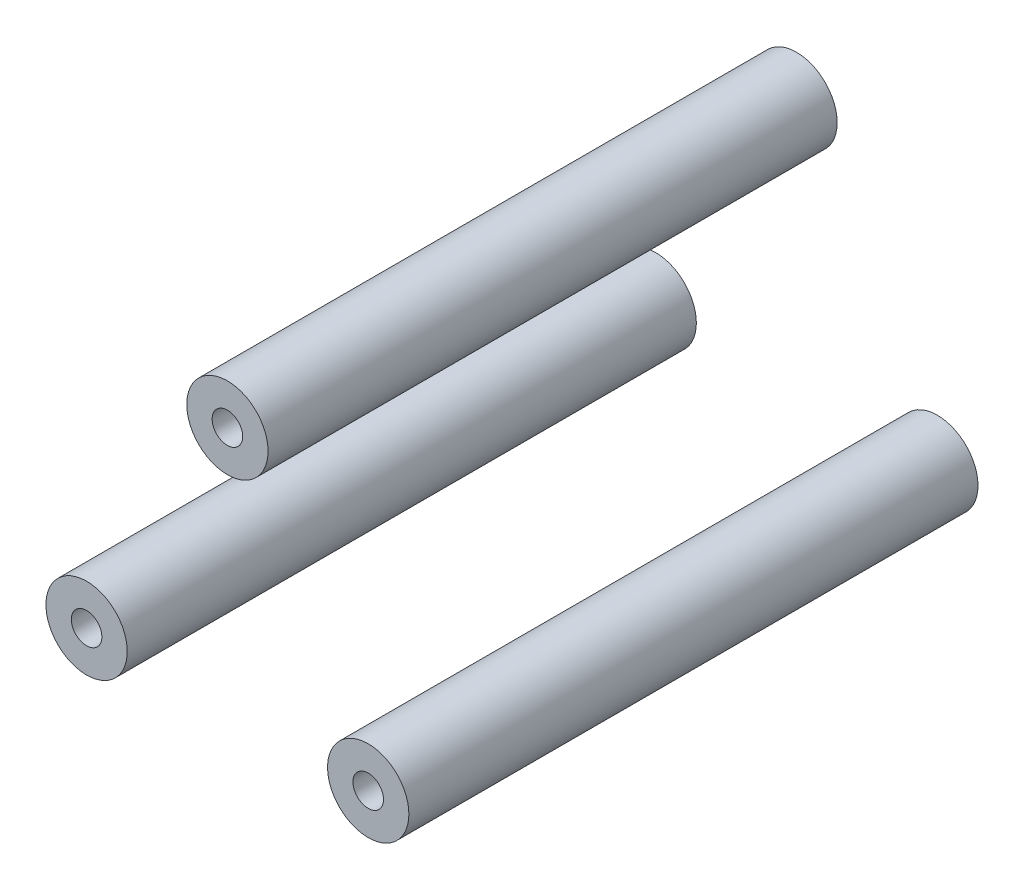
ISO-10303-21;
HEADER;
FILE_DESCRIPTION(('STEP AP214'),'2;1');
FILE_NAME('part.step','',(''),(''),'','','');
FILE_SCHEMA(('AUTOMOTIVE_DESIGN { 1 0 10303 214 1 1 1 1 }'));
ENDSEC;
DATA;
#1=APPLICATION_CONTEXT('core data for automotive mechanical design processes');
#2=APPLICATION_PROTOCOL_DEFINITION('international standard','automotive_design',2000,#1);
#3=PRODUCT_CONTEXT('',#1,'mechanical');
#4=PRODUCT('Part','Part','',(#3));
#5=PRODUCT_RELATED_PRODUCT_CATEGORY('part','',(#4));
#6=PRODUCT_DEFINITION_FORMATION('','',#4);
#7=PRODUCT_DEFINITION_CONTEXT('part definition',#1,'design');
#8=PRODUCT_DEFINITION('design','',#6,#7);
#9=PRODUCT_DEFINITION_SHAPE('','',#8);
#10=(LENGTH_UNIT() NAMED_UNIT(*) SI_UNIT(.MILLI.,.METRE.));
#11=(NAMED_UNIT(*) PLANE_ANGLE_UNIT() SI_UNIT($,.RADIAN.));
#12=(NAMED_UNIT(*) SI_UNIT($,.STERADIAN.) SOLID_ANGLE_UNIT());
#13=UNCERTAINTY_MEASURE_WITH_UNIT(LENGTH_MEASURE(1.E-05),#10,'distance_accuracy_value','');
#14=(GEOMETRIC_REPRESENTATION_CONTEXT(3) GLOBAL_UNCERTAINTY_ASSIGNED_CONTEXT((#13)) GLOBAL_UNIT_ASSIGNED_CONTEXT((#10,
#11,#12)) REPRESENTATION_CONTEXT('',''));
#15=CARTESIAN_POINT('',(0.,0.,0.));
#16=DIRECTION('',(0.,0.,1.));
#17=DIRECTION('',(1.,0.,0.));
#18=AXIS2_PLACEMENT_3D('',#15,#16,#17);
#19=CARTESIAN_POINT('',(0.,25.4,88.9));
#20=DIRECTION('',(0.,0.,1.));
#21=DIRECTION('',(1.,0.,0.));
#22=AXIS2_PLACEMENT_3D('',#19,#20,#21);
#23=PLANE('',#22);
#24=CARTESIAN_POINT('',(0.,25.4,88.9));
#25=DIRECTION('',(0.,0.,1.));
#26=DIRECTION('',(1.,0.,0.));
#27=AXIS2_PLACEMENT_3D('',#24,#25,#26);
#28=CIRCLE('',#27,6.35);
#29=CARTESIAN_POINT('',(6.35,25.4,88.9));
#30=VERTEX_POINT('',#29);
#31=EDGE_CURVE('E11',#30,#30,#28,.T.);
#32=ORIENTED_EDGE('',*,*,#31,.T.);
#33=EDGE_LOOP('',(#32));
#34=FACE_BOUND('',#33,.T.);
#35=CARTESIAN_POINT('',(0.,25.4,88.9));
#36=DIRECTION('',(0.,0.,1.));
#37=DIRECTION('',(1.,0.,0.));
#38=AXIS2_PLACEMENT_3D('',#35,#36,#37);
#39=CIRCLE('',#38,2.3876);
#40=CARTESIAN_POINT('',(2.3876,25.4,88.9));
#41=VERTEX_POINT('',#40);
#42=EDGE_CURVE('E51',#41,#41,#39,.T.);
#43=ORIENTED_EDGE('',*,*,#42,.F.);
#44=EDGE_LOOP('',(#43));
#45=FACE_BOUND('',#44,.T.);
#46=ADVANCED_FACE('F40',(#34,#45),#23,.T.);
#47=CARTESIAN_POINT('',(0.,25.4,0.));
#48=DIRECTION('',(0.,0.,1.));
#49=DIRECTION('',(1.,0.,0.));
#50=AXIS2_PLACEMENT_3D('',#47,#48,#49);
#51=PLANE('',#50);
#52=CARTESIAN_POINT('',(0.,25.4,0.));
#53=DIRECTION('',(0.,0.,1.));
#54=DIRECTION('',(1.,0.,0.));
#55=AXIS2_PLACEMENT_3D('',#52,#53,#54);
#56=CIRCLE('',#55,6.35);
#57=CARTESIAN_POINT('',(6.35,25.4,0.));
#58=VERTEX_POINT('',#57);
#59=EDGE_CURVE('E44',#58,#58,#56,.T.);
#60=ORIENTED_EDGE('',*,*,#59,.F.);
#61=EDGE_LOOP('',(#60));
#62=FACE_BOUND('',#61,.T.);
#63=CARTESIAN_POINT('',(0.,25.4,0.));
#64=DIRECTION('',(0.,0.,1.));
#65=DIRECTION('',(1.,0.,0.));
#66=AXIS2_PLACEMENT_3D('',#63,#64,#65);
#67=CIRCLE('',#66,2.3876);
#68=CARTESIAN_POINT('',(2.3876,25.4,0.));
#69=VERTEX_POINT('',#68);
#70=EDGE_CURVE('E53',#69,#69,#67,.T.);
#71=ORIENTED_EDGE('',*,*,#70,.T.);
#72=EDGE_LOOP('',(#71));
#73=FACE_BOUND('',#72,.T.);
#74=ADVANCED_FACE('F63',(#62,#73),#51,.F.);
#75=CARTESIAN_POINT('',(0.,25.4,88.9));
#76=DIRECTION('',(0.,0.,-1.));
#77=DIRECTION('',(-1.,0.,0.));
#78=AXIS2_PLACEMENT_3D('',#75,#76,#77);
#79=CYLINDRICAL_SURFACE('',#78,6.35);
#80=ORIENTED_EDGE('',*,*,#31,.F.);
#81=EDGE_LOOP('',(#80));
#82=FACE_BOUND('',#81,.T.);
#83=ORIENTED_EDGE('',*,*,#59,.T.);
#84=EDGE_LOOP('',(#83));
#85=FACE_BOUND('',#84,.T.);
#86=ADVANCED_FACE('F42',(#82,#85),#79,.T.);
#87=CARTESIAN_POINT('',(0.,25.4,88.9));
#88=DIRECTION('',(0.,0.,-1.));
#89=DIRECTION('',(-1.,0.,0.));
#90=AXIS2_PLACEMENT_3D('',#87,#88,#89);
#91=CYLINDRICAL_SURFACE('',#90,2.3876);
#92=ORIENTED_EDGE('',*,*,#42,.T.);
#93=EDGE_LOOP('',(#92));
#94=FACE_BOUND('',#93,.T.);
#95=ORIENTED_EDGE('',*,*,#70,.F.);
#96=EDGE_LOOP('',(#95));
#97=FACE_BOUND('',#96,.T.);
#98=ADVANCED_FACE('F59',(#94,#97),#91,.F.);
#99=CLOSED_SHELL('',(#46,#74,#86,#98));
#100=MANIFOLD_SOLID_BREP('B2',#99);
#101=CARTESIAN_POINT('',(21.9970452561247,-12.7000000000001,88.9));
#102=DIRECTION('',(0.,0.,1.));
#103=DIRECTION('',(1.,0.,0.));
#104=AXIS2_PLACEMENT_3D('',#101,#102,#103);
#105=PLANE('',#104);
#106=CARTESIAN_POINT('',(21.9970452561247,-12.7000000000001,88.9));
#107=DIRECTION('',(0.,0.,1.));
#108=DIRECTION('',(1.,0.,0.));
#109=AXIS2_PLACEMENT_3D('',#106,#107,#108);
#110=CIRCLE('',#109,6.35);
#111=CARTESIAN_POINT('',(28.3470452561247,-12.7000000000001,88.9));
#112=VERTEX_POINT('',#111);
#113=EDGE_CURVE('E39',#112,#112,#110,.T.);
#114=ORIENTED_EDGE('',*,*,#113,.T.);
#115=EDGE_LOOP('',(#114));
#116=FACE_BOUND('',#115,.T.);
#117=CARTESIAN_POINT('',(21.9970452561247,-12.7000000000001,88.9));
#118=DIRECTION('',(0.,0.,1.));
#119=DIRECTION('',(1.,0.,0.));
#120=AXIS2_PLACEMENT_3D('',#117,#118,#119);
#121=CIRCLE('',#120,2.38760000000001);
#122=CARTESIAN_POINT('',(24.3846452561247,-12.7000000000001,88.9));
#123=VERTEX_POINT('',#122);
#124=EDGE_CURVE('E120',#123,#123,#121,.T.);
#125=ORIENTED_EDGE('',*,*,#124,.F.);
#126=EDGE_LOOP('',(#125));
#127=FACE_BOUND('',#126,.T.);
#128=ADVANCED_FACE('F109',(#116,#127),#105,.T.);
#129=CARTESIAN_POINT('',(21.9970452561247,-12.7000000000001,0.));
#130=DIRECTION('',(0.,0.,1.));
#131=DIRECTION('',(1.,0.,0.));
#132=AXIS2_PLACEMENT_3D('',#129,#130,#131);
#133=PLANE('',#132);
#134=CARTESIAN_POINT('',(21.9970452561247,-12.7000000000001,0.));
#135=DIRECTION('',(0.,0.,1.));
#136=DIRECTION('',(1.,0.,0.));
#137=AXIS2_PLACEMENT_3D('',#134,#135,#136);
#138=CIRCLE('',#137,6.35);
#139=CARTESIAN_POINT('',(28.3470452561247,-12.7000000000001,0.));
#140=VERTEX_POINT('',#139);
#141=EDGE_CURVE('E113',#140,#140,#138,.T.);
#142=ORIENTED_EDGE('',*,*,#141,.F.);
#143=EDGE_LOOP('',(#142));
#144=FACE_BOUND('',#143,.T.);
#145=CARTESIAN_POINT('',(21.9970452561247,-12.7000000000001,0.));
#146=DIRECTION('',(0.,0.,1.));
#147=DIRECTION('',(1.,0.,0.));
#148=AXIS2_PLACEMENT_3D('',#145,#146,#147);
#149=CIRCLE('',#148,2.38760000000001);
#150=CARTESIAN_POINT('',(24.3846452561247,-12.7000000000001,0.));
#151=VERTEX_POINT('',#150);
#152=EDGE_CURVE('E122',#151,#151,#149,.T.);
#153=ORIENTED_EDGE('',*,*,#152,.T.);
#154=EDGE_LOOP('',(#153));
#155=FACE_BOUND('',#154,.T.);
#156=ADVANCED_FACE('F132',(#144,#155),#133,.F.);
#157=CARTESIAN_POINT('',(21.9970452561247,-12.7000000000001,88.9));
#158=DIRECTION('',(0.,0.,-1.));
#159=DIRECTION('',(-1.,0.,0.));
#160=AXIS2_PLACEMENT_3D('',#157,#158,#159);
#161=CYLINDRICAL_SURFACE('',#160,6.35);
#162=ORIENTED_EDGE('',*,*,#113,.F.);
#163=EDGE_LOOP('',(#162));
#164=FACE_BOUND('',#163,.T.);
#165=ORIENTED_EDGE('',*,*,#141,.T.);
#166=EDGE_LOOP('',(#165));
#167=FACE_BOUND('',#166,.T.);
#168=ADVANCED_FACE('F111',(#164,#167),#161,.T.);
#169=CARTESIAN_POINT('',(21.9970452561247,-12.7000000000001,88.9));
#170=DIRECTION('',(0.,0.,-1.));
#171=DIRECTION('',(-1.,0.,0.));
#172=AXIS2_PLACEMENT_3D('',#169,#170,#171);
#173=CYLINDRICAL_SURFACE('',#172,2.38760000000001);
#174=ORIENTED_EDGE('',*,*,#124,.T.);
#175=EDGE_LOOP('',(#174));
#176=FACE_BOUND('',#175,.T.);
#177=ORIENTED_EDGE('',*,*,#152,.F.);
#178=EDGE_LOOP('',(#177));
#179=FACE_BOUND('',#178,.T.);
#180=ADVANCED_FACE('F128',(#176,#179),#173,.F.);
#181=CLOSED_SHELL('',(#128,#156,#168,#180));
#182=MANIFOLD_SOLID_BREP('B6',#181);
#183=CARTESIAN_POINT('',(-21.9970452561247,-12.7000000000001,88.9));
#184=DIRECTION('',(0.,0.,1.));
#185=DIRECTION('',(1.,0.,0.));
#186=AXIS2_PLACEMENT_3D('',#183,#184,#185);
#187=PLANE('',#186);
#188=CARTESIAN_POINT('',(-21.9970452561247,-12.7000000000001,88.9));
#189=DIRECTION('',(0.,0.,1.));
#190=DIRECTION('',(1.,0.,0.));
#191=AXIS2_PLACEMENT_3D('',#188,#189,#190);
#192=CIRCLE('',#191,6.35);
#193=CARTESIAN_POINT('',(-15.6470452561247,-12.7000000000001,88.9));
#194=VERTEX_POINT('',#193);
#195=EDGE_CURVE('E108',#194,#194,#192,.T.);
#196=ORIENTED_EDGE('',*,*,#195,.T.);
#197=EDGE_LOOP('',(#196));
#198=FACE_BOUND('',#197,.T.);
#199=CARTESIAN_POINT('',(-21.9970452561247,-12.7000000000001,88.9));
#200=DIRECTION('',(0.,0.,1.));
#201=DIRECTION('',(1.,0.,0.));
#202=AXIS2_PLACEMENT_3D('',#199,#200,#201);
#203=CIRCLE('',#202,2.38760000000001);
#204=CARTESIAN_POINT('',(-19.6094452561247,-12.7000000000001,88.9));
#205=VERTEX_POINT('',#204);
#206=EDGE_CURVE('E182',#205,#205,#203,.T.);
#207=ORIENTED_EDGE('',*,*,#206,.F.);
#208=EDGE_LOOP('',(#207));
#209=FACE_BOUND('',#208,.T.);
#210=ADVANCED_FACE('F171',(#198,#209),#187,.T.);
#211=CARTESIAN_POINT('',(-21.9970452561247,-12.7000000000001,0.));
#212=DIRECTION('',(0.,0.,1.));
#213=DIRECTION('',(1.,0.,0.));
#214=AXIS2_PLACEMENT_3D('',#211,#212,#213);
#215=PLANE('',#214);
#216=CARTESIAN_POINT('',(-21.9970452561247,-12.7000000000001,0.));
#217=DIRECTION('',(0.,0.,1.));
#218=DIRECTION('',(1.,0.,0.));
#219=AXIS2_PLACEMENT_3D('',#216,#217,#218);
#220=CIRCLE('',#219,6.35);
#221=CARTESIAN_POINT('',(-15.6470452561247,-12.7000000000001,0.));
#222=VERTEX_POINT('',#221);
#223=EDGE_CURVE('E175',#222,#222,#220,.T.);
#224=ORIENTED_EDGE('',*,*,#223,.F.);
#225=EDGE_LOOP('',(#224));
#226=FACE_BOUND('',#225,.T.);
#227=CARTESIAN_POINT('',(-21.9970452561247,-12.7000000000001,0.));
#228=DIRECTION('',(0.,0.,1.));
#229=DIRECTION('',(1.,0.,0.));
#230=AXIS2_PLACEMENT_3D('',#227,#228,#229);
#231=CIRCLE('',#230,2.38760000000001);
#232=CARTESIAN_POINT('',(-19.6094452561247,-12.7000000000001,0.));
#233=VERTEX_POINT('',#232);
#234=EDGE_CURVE('E184',#233,#233,#231,.T.);
#235=ORIENTED_EDGE('',*,*,#234,.T.);
#236=EDGE_LOOP('',(#235));
#237=FACE_BOUND('',#236,.T.);
#238=ADVANCED_FACE('F194',(#226,#237),#215,.F.);
#239=CARTESIAN_POINT('',(-21.9970452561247,-12.7000000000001,88.9));
#240=DIRECTION('',(0.,0.,-1.));
#241=DIRECTION('',(-1.,0.,0.));
#242=AXIS2_PLACEMENT_3D('',#239,#240,#241);
#243=CYLINDRICAL_SURFACE('',#242,6.35);
#244=ORIENTED_EDGE('',*,*,#195,.F.);
#245=EDGE_LOOP('',(#244));
#246=FACE_BOUND('',#245,.T.);
#247=ORIENTED_EDGE('',*,*,#223,.T.);
#248=EDGE_LOOP('',(#247));
#249=FACE_BOUND('',#248,.T.);
#250=ADVANCED_FACE('F173',(#246,#249),#243,.T.);
#251=CARTESIAN_POINT('',(-21.9970452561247,-12.7000000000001,88.9));
#252=DIRECTION('',(0.,0.,-1.));
#253=DIRECTION('',(-1.,0.,0.));
#254=AXIS2_PLACEMENT_3D('',#251,#252,#253);
#255=CYLINDRICAL_SURFACE('',#254,2.38760000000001);
#256=ORIENTED_EDGE('',*,*,#206,.T.);
#257=EDGE_LOOP('',(#256));
#258=FACE_BOUND('',#257,.T.);
#259=ORIENTED_EDGE('',*,*,#234,.F.);
#260=EDGE_LOOP('',(#259));
#261=FACE_BOUND('',#260,.T.);
#262=ADVANCED_FACE('F190',(#258,#261),#255,.F.);
#263=CLOSED_SHELL('',(#210,#238,#250,#262));
#264=MANIFOLD_SOLID_BREP('B34',#263);
#265=ADVANCED_BREP_SHAPE_REPRESENTATION('',(#18,#100,#182,#264),#14);
#266=SHAPE_DEFINITION_REPRESENTATION(#9,#265);
ENDSEC;
END-ISO-10303-21;
